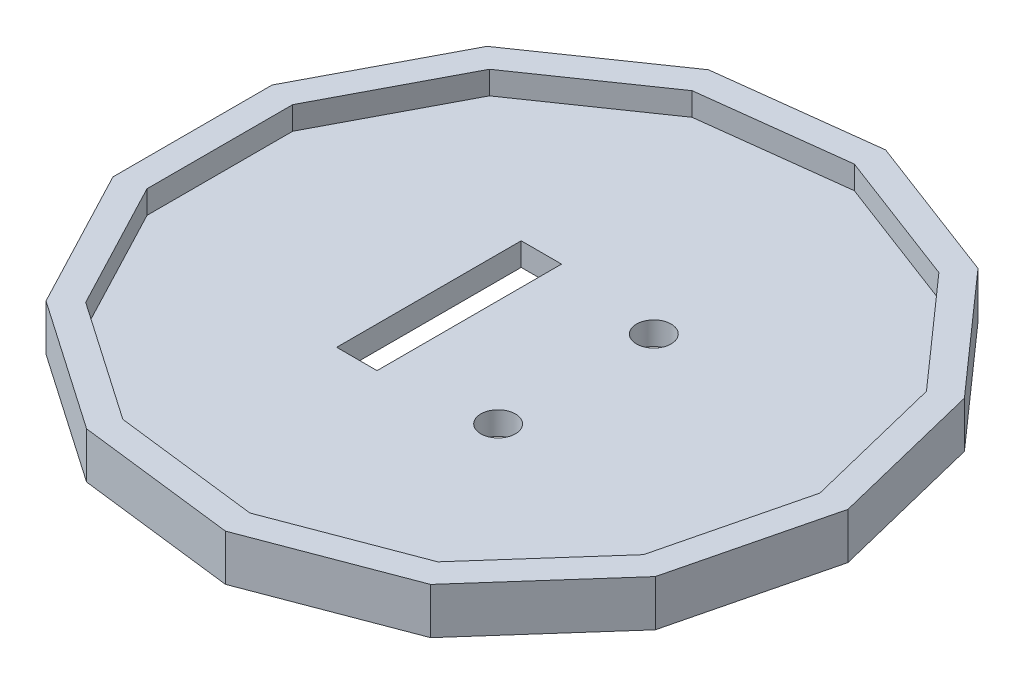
ISO-10303-21;
HEADER;
FILE_DESCRIPTION(('STEP AP214'),'2;1');
FILE_NAME('part.step','',(''),(''),'','','');
FILE_SCHEMA(('AUTOMOTIVE_DESIGN { 1 0 10303 214 1 1 1 1 }'));
ENDSEC;
DATA;
#1=APPLICATION_CONTEXT('core data for automotive mechanical design processes');
#2=APPLICATION_PROTOCOL_DEFINITION('international standard','automotive_design',2000,#1);
#3=PRODUCT_CONTEXT('',#1,'mechanical');
#4=PRODUCT('Part','Part','',(#3));
#5=PRODUCT_RELATED_PRODUCT_CATEGORY('part','',(#4));
#6=PRODUCT_DEFINITION_FORMATION('','',#4);
#7=PRODUCT_DEFINITION_CONTEXT('part definition',#1,'design');
#8=PRODUCT_DEFINITION('design','',#6,#7);
#9=PRODUCT_DEFINITION_SHAPE('','',#8);
#10=(LENGTH_UNIT() NAMED_UNIT(*) SI_UNIT(.MILLI.,.METRE.));
#11=(NAMED_UNIT(*) PLANE_ANGLE_UNIT() SI_UNIT($,.RADIAN.));
#12=(NAMED_UNIT(*) SI_UNIT($,.STERADIAN.) SOLID_ANGLE_UNIT());
#13=UNCERTAINTY_MEASURE_WITH_UNIT(LENGTH_MEASURE(1.E-05),#10,'distance_accuracy_value','');
#14=(GEOMETRIC_REPRESENTATION_CONTEXT(3) GLOBAL_UNCERTAINTY_ASSIGNED_CONTEXT((#13)) GLOBAL_UNIT_ASSIGNED_CONTEXT((#10,
#11,#12)) REPRESENTATION_CONTEXT('',''));
#15=CARTESIAN_POINT('',(0.,0.,0.));
#16=DIRECTION('',(0.,0.,1.));
#17=DIRECTION('',(1.,0.,0.));
#18=AXIS2_PLACEMENT_3D('',#15,#16,#17);
#19=CARTESIAN_POINT('',(-10.226088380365,4.,-26.9639790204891));
#20=DIRECTION('',(0.568064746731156,0.,0.822983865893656));
#21=DIRECTION('',(0.822983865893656,0.,-0.568064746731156));
#22=AXIS2_PLACEMENT_3D('',#19,#20,#21);
#23=PLANE('',#22);
#24=DIRECTION('',(-0.822983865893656,0.,0.568064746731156));
#25=VECTOR('',#24,1.);
#26=CARTESIAN_POINT('',(-10.226088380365,0.,-26.9639790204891));
#27=LINE('',#26,#25);
#28=CARTESIAN_POINT('',(-10.226088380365,0.,-26.9639790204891));
#29=VERTEX_POINT('',#28);
#30=CARTESIAN_POINT('',(-21.5855374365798,0.,-19.1231174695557));
#31=VERTEX_POINT('',#30);
#32=EDGE_CURVE('E359',#29,#31,#27,.T.);
#33=ORIENTED_EDGE('',*,*,#32,.T.);
#34=DIRECTION('',(0.,-1.,0.));
#35=VECTOR('',#34,1.);
#36=CARTESIAN_POINT('',(-21.5855374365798,4.,-19.1231174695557));
#37=LINE('',#36,#35);
#38=CARTESIAN_POINT('',(-21.5855374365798,4.,-19.1231174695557));
#39=VERTEX_POINT('',#38);
#40=EDGE_CURVE('E11',#39,#31,#37,.T.);
#41=ORIENTED_EDGE('',*,*,#40,.F.);
#42=DIRECTION('',(-0.822983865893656,0.,0.568064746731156));
#43=VECTOR('',#42,1.);
#44=CARTESIAN_POINT('',(-10.226088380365,4.,-26.9639790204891));
#45=LINE('',#44,#43);
#46=CARTESIAN_POINT('',(-10.226088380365,4.,-26.9639790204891));
#47=VERTEX_POINT('',#46);
#48=EDGE_CURVE('E384',#47,#39,#45,.T.);
#49=ORIENTED_EDGE('',*,*,#48,.F.);
#50=DIRECTION('',(0.,-1.,0.));
#51=VECTOR('',#50,1.);
#52=CARTESIAN_POINT('',(-10.226088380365,4.,-26.9639790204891));
#53=LINE('',#52,#51);
#54=EDGE_CURVE('E412',#47,#29,#53,.T.);
#55=ORIENTED_EDGE('',*,*,#54,.T.);
#56=EDGE_LOOP('',(#33,#41,#49,#55));
#57=FACE_BOUND('',#56,.T.);
#58=ADVANCED_FACE('F37',(#57),#23,.F.);
#59=CARTESIAN_POINT('',(-21.5855374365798,4.,-19.1231174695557));
#60=DIRECTION('',(0.88545602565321,0.,0.464723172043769));
#61=DIRECTION('',(0.464723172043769,0.,-0.88545602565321));
#62=AXIS2_PLACEMENT_3D('',#59,#60,#61);
#63=PLANE('',#62);
#64=DIRECTION('',(-0.464723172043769,0.,0.88545602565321));
#65=VECTOR('',#64,1.);
#66=CARTESIAN_POINT('',(-21.5855374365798,0.,-19.1231174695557));
#67=LINE('',#66,#65);
#68=CARTESIAN_POINT('',(-28.,0.,-6.90138016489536));
#69=VERTEX_POINT('',#68);
#70=EDGE_CURVE('E415',#31,#69,#67,.T.);
#71=ORIENTED_EDGE('',*,*,#70,.T.);
#72=DIRECTION('',(0.,-1.,0.));
#73=VECTOR('',#72,1.);
#74=CARTESIAN_POINT('',(-28.,4.,-6.90138016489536));
#75=LINE('',#74,#73);
#76=CARTESIAN_POINT('',(-28.,4.,-6.90138016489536));
#77=VERTEX_POINT('',#76);
#78=EDGE_CURVE('E44',#77,#69,#75,.T.);
#79=ORIENTED_EDGE('',*,*,#78,.F.);
#80=DIRECTION('',(-0.464723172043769,0.,0.88545602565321));
#81=VECTOR('',#80,1.);
#82=CARTESIAN_POINT('',(-21.5855374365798,4.,-19.1231174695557));
#83=LINE('',#82,#81);
#84=EDGE_CURVE('E387',#39,#77,#83,.T.);
#85=ORIENTED_EDGE('',*,*,#84,.F.);
#86=ORIENTED_EDGE('',*,*,#40,.T.);
#87=EDGE_LOOP('',(#71,#79,#85,#86));
#88=FACE_BOUND('',#87,.T.);
#89=ADVANCED_FACE('F497',(#88),#63,.F.);
#90=CARTESIAN_POINT('',(-28.,4.,-6.90138016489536));
#91=DIRECTION('',(1.,0.,0.));
#92=DIRECTION('',(0.,0.,-1.));
#93=AXIS2_PLACEMENT_3D('',#90,#91,#92);
#94=PLANE('',#93);
#95=DIRECTION('',(0.,0.,1.));
#96=VECTOR('',#95,1.);
#97=CARTESIAN_POINT('',(-28.,0.,-6.90138016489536));
#98=LINE('',#97,#96);
#99=CARTESIAN_POINT('',(-28.,0.,6.90138016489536));
#100=VERTEX_POINT('',#99);
#101=EDGE_CURVE('E417',#69,#100,#98,.T.);
#102=ORIENTED_EDGE('',*,*,#101,.T.);
#103=DIRECTION('',(0.,-1.,0.));
#104=VECTOR('',#103,1.);
#105=CARTESIAN_POINT('',(-28.,4.,6.90138016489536));
#106=LINE('',#105,#104);
#107=CARTESIAN_POINT('',(-28.,4.,6.90138016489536));
#108=VERTEX_POINT('',#107);
#109=EDGE_CURVE('E467',#108,#100,#106,.T.);
#110=ORIENTED_EDGE('',*,*,#109,.F.);
#111=DIRECTION('',(0.,0.,1.));
#112=VECTOR('',#111,1.);
#113=CARTESIAN_POINT('',(-28.,4.,-6.90138016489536));
#114=LINE('',#113,#112);
#115=EDGE_CURVE('E390',#77,#108,#114,.T.);
#116=ORIENTED_EDGE('',*,*,#115,.F.);
#117=ORIENTED_EDGE('',*,*,#78,.T.);
#118=EDGE_LOOP('',(#102,#110,#116,#117));
#119=FACE_BOUND('',#118,.T.);
#120=ADVANCED_FACE('F474',(#119),#94,.F.);
#121=CARTESIAN_POINT('',(-28.,4.,6.90138016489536));
#122=DIRECTION('',(0.88545602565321,0.,-0.464723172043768));
#123=DIRECTION('',(-0.464723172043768,0.,-0.88545602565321));
#124=AXIS2_PLACEMENT_3D('',#121,#122,#123);
#125=PLANE('',#124);
#126=DIRECTION('',(0.464723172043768,0.,0.88545602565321));
#127=VECTOR('',#126,1.);
#128=CARTESIAN_POINT('',(-28.,0.,6.90138016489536));
#129=LINE('',#128,#127);
#130=CARTESIAN_POINT('',(-21.5855374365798,0.,19.1231174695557));
#131=VERTEX_POINT('',#130);
#132=EDGE_CURVE('E419',#100,#131,#129,.T.);
#133=ORIENTED_EDGE('',*,*,#132,.T.);
#134=DIRECTION('',(0.,-1.,0.));
#135=VECTOR('',#134,1.);
#136=CARTESIAN_POINT('',(-21.5855374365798,4.,19.1231174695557));
#137=LINE('',#136,#135);
#138=CARTESIAN_POINT('',(-21.5855374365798,4.,19.1231174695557));
#139=VERTEX_POINT('',#138);
#140=EDGE_CURVE('E464',#139,#131,#137,.T.);
#141=ORIENTED_EDGE('',*,*,#140,.F.);
#142=DIRECTION('',(0.464723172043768,0.,0.88545602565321));
#143=VECTOR('',#142,1.);
#144=CARTESIAN_POINT('',(-28.,4.,6.90138016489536));
#145=LINE('',#144,#143);
#146=EDGE_CURVE('E392',#108,#139,#145,.T.);
#147=ORIENTED_EDGE('',*,*,#146,.F.);
#148=ORIENTED_EDGE('',*,*,#109,.T.);
#149=EDGE_LOOP('',(#133,#141,#147,#148));
#150=FACE_BOUND('',#149,.T.);
#151=ADVANCED_FACE('F485',(#150),#125,.F.);
#152=CARTESIAN_POINT('',(-21.5855374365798,4.,19.1231174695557));
#153=DIRECTION('',(0.568064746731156,0.,-0.822983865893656));
#154=DIRECTION('',(-0.822983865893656,0.,-0.568064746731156));
#155=AXIS2_PLACEMENT_3D('',#152,#153,#154);
#156=PLANE('',#155);
#157=DIRECTION('',(0.822983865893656,0.,0.568064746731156));
#158=VECTOR('',#157,1.);
#159=CARTESIAN_POINT('',(-21.5855374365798,0.,19.1231174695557));
#160=LINE('',#159,#158);
#161=CARTESIAN_POINT('',(-10.226088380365,0.,26.9639790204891));
#162=VERTEX_POINT('',#161);
#163=EDGE_CURVE('E421',#131,#162,#160,.T.);
#164=ORIENTED_EDGE('',*,*,#163,.T.);
#165=DIRECTION('',(0.,-1.,0.));
#166=VECTOR('',#165,1.);
#167=CARTESIAN_POINT('',(-10.226088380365,4.,26.9639790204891));
#168=LINE('',#167,#166);
#169=CARTESIAN_POINT('',(-10.226088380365,4.,26.9639790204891));
#170=VERTEX_POINT('',#169);
#171=EDGE_CURVE('E461',#170,#162,#168,.T.);
#172=ORIENTED_EDGE('',*,*,#171,.F.);
#173=DIRECTION('',(0.822983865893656,0.,0.568064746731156));
#174=VECTOR('',#173,1.);
#175=CARTESIAN_POINT('',(-21.5855374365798,4.,19.1231174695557));
#176=LINE('',#175,#174);
#177=EDGE_CURVE('E394',#139,#170,#176,.T.);
#178=ORIENTED_EDGE('',*,*,#177,.F.);
#179=ORIENTED_EDGE('',*,*,#140,.T.);
#180=EDGE_LOOP('',(#164,#172,#178,#179));
#181=FACE_BOUND('',#180,.T.);
#182=ADVANCED_FACE('F489',(#181),#156,.F.);
#183=CARTESIAN_POINT('',(-10.226088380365,4.,26.9639790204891));
#184=DIRECTION('',(0.120536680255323,0.,-0.992708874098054));
#185=DIRECTION('',(-0.992708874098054,0.,-0.120536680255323));
#186=AXIS2_PLACEMENT_3D('',#183,#184,#185);
#187=PLANE('',#186);
#188=DIRECTION('',(0.992708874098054,0.,0.120536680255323));
#189=VECTOR('',#188,1.);
#190=CARTESIAN_POINT('',(-10.226088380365,0.,26.9639790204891));
#191=LINE('',#190,#189);
#192=CARTESIAN_POINT('',(3.47603428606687,0.,28.6277179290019));
#193=VERTEX_POINT('',#192);
#194=EDGE_CURVE('E423',#162,#193,#191,.T.);
#195=ORIENTED_EDGE('',*,*,#194,.T.);
#196=DIRECTION('',(0.,-1.,0.));
#197=VECTOR('',#196,1.);
#198=CARTESIAN_POINT('',(3.47603428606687,4.,28.6277179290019));
#199=LINE('',#198,#197);
#200=CARTESIAN_POINT('',(3.47603428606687,4.,28.6277179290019));
#201=VERTEX_POINT('',#200);
#202=EDGE_CURVE('E458',#201,#193,#199,.T.);
#203=ORIENTED_EDGE('',*,*,#202,.F.);
#204=DIRECTION('',(0.992708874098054,0.,0.120536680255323));
#205=VECTOR('',#204,1.);
#206=CARTESIAN_POINT('',(-10.226088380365,4.,26.9639790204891));
#207=LINE('',#206,#205);
#208=EDGE_CURVE('E396',#170,#201,#207,.T.);
#209=ORIENTED_EDGE('',*,*,#208,.F.);
#210=ORIENTED_EDGE('',*,*,#171,.T.);
#211=EDGE_LOOP('',(#195,#203,#209,#210));
#212=FACE_BOUND('',#211,.T.);
#213=ADVANCED_FACE('F535',(#212),#187,.F.);
#214=CARTESIAN_POINT('',(3.47603428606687,4.,28.6277179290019));
#215=DIRECTION('',(-0.354604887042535,0.,-0.935016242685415));
#216=DIRECTION('',(-0.935016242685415,0.,0.354604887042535));
#217=AXIS2_PLACEMENT_3D('',#214,#215,#216);
#218=PLANE('',#217);
#219=DIRECTION('',(0.935016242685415,0.,-0.354604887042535));
#220=VECTOR('',#219,1.);
#221=CARTESIAN_POINT('',(3.47603428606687,0.,28.6277179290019));
#222=LINE('',#221,#220);
#223=CARTESIAN_POINT('',(16.3818393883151,0.,23.7331916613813));
#224=VERTEX_POINT('',#223);
#225=EDGE_CURVE('E425',#193,#224,#222,.T.);
#226=ORIENTED_EDGE('',*,*,#225,.T.);
#227=DIRECTION('',(0.,-1.,0.));
#228=VECTOR('',#227,1.);
#229=CARTESIAN_POINT('',(16.3818393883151,4.,23.7331916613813));
#230=LINE('',#229,#228);
#231=CARTESIAN_POINT('',(16.3818393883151,4.,23.7331916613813));
#232=VERTEX_POINT('',#231);
#233=EDGE_CURVE('E455',#232,#224,#230,.T.);
#234=ORIENTED_EDGE('',*,*,#233,.F.);
#235=DIRECTION('',(0.935016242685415,0.,-0.354604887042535));
#236=VECTOR('',#235,1.);
#237=CARTESIAN_POINT('',(3.47603428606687,4.,28.6277179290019));
#238=LINE('',#237,#236);
#239=EDGE_CURVE('E398',#201,#232,#238,.T.);
#240=ORIENTED_EDGE('',*,*,#239,.F.);
#241=ORIENTED_EDGE('',*,*,#202,.T.);
#242=EDGE_LOOP('',(#226,#234,#240,#241));
#243=FACE_BOUND('',#242,.T.);
#244=ADVANCED_FACE('F532',(#243),#218,.F.);
#245=CARTESIAN_POINT('',(16.3818393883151,4.,23.7331916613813));
#246=DIRECTION('',(-0.748510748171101,0.,-0.663122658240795));
#247=DIRECTION('',(-0.663122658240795,0.,0.748510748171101));
#248=AXIS2_PLACEMENT_3D('',#245,#246,#247);
#249=PLANE('',#248);
#250=DIRECTION('',(0.663122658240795,0.,-0.748510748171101));
#251=VECTOR('',#250,1.);
#252=CARTESIAN_POINT('',(16.3818393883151,0.,23.7331916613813));
#253=LINE('',#252,#251);
#254=CARTESIAN_POINT('',(25.5347625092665,0.,13.4016772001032));
#255=VERTEX_POINT('',#254);
#256=EDGE_CURVE('E427',#224,#255,#253,.T.);
#257=ORIENTED_EDGE('',*,*,#256,.T.);
#258=DIRECTION('',(0.,-1.,0.));
#259=VECTOR('',#258,1.);
#260=CARTESIAN_POINT('',(25.5347625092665,4.,13.4016772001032));
#261=LINE('',#260,#259);
#262=CARTESIAN_POINT('',(25.5347625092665,4.,13.4016772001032));
#263=VERTEX_POINT('',#262);
#264=EDGE_CURVE('E452',#263,#255,#261,.T.);
#265=ORIENTED_EDGE('',*,*,#264,.F.);
#266=DIRECTION('',(0.663122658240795,0.,-0.748510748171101));
#267=VECTOR('',#266,1.);
#268=CARTESIAN_POINT('',(16.3818393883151,4.,23.7331916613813));
#269=LINE('',#268,#267);
#270=EDGE_CURVE('E400',#232,#263,#269,.T.);
#271=ORIENTED_EDGE('',*,*,#270,.F.);
#272=ORIENTED_EDGE('',*,*,#233,.T.);
#273=EDGE_LOOP('',(#257,#265,#271,#272));
#274=FACE_BOUND('',#273,.T.);
#275=ADVANCED_FACE('F528',(#274),#249,.F.);
#276=CARTESIAN_POINT('',(25.5347625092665,4.,13.4016772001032));
#277=DIRECTION('',(-0.970941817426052,0.,-0.239315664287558));
#278=DIRECTION('',(-0.239315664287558,0.,0.970941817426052));
#279=AXIS2_PLACEMENT_3D('',#276,#277,#278);
#280=PLANE('',#279);
#281=DIRECTION('',(0.239315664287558,0.,-0.970941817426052));
#282=VECTOR('',#281,1.);
#283=CARTESIAN_POINT('',(25.5347625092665,0.,13.4016772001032));
#284=LINE('',#283,#282);
#285=CARTESIAN_POINT('',(28.8379792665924,0.,0.));
#286=VERTEX_POINT('',#285);
#287=EDGE_CURVE('E429',#255,#286,#284,.T.);
#288=ORIENTED_EDGE('',*,*,#287,.T.);
#289=DIRECTION('',(0.,-1.,0.));
#290=VECTOR('',#289,1.);
#291=CARTESIAN_POINT('',(28.8379792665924,4.,0.));
#292=LINE('',#291,#290);
#293=CARTESIAN_POINT('',(28.8379792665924,4.,0.));
#294=VERTEX_POINT('',#293);
#295=EDGE_CURVE('E449',#294,#286,#292,.T.);
#296=ORIENTED_EDGE('',*,*,#295,.F.);
#297=DIRECTION('',(0.239315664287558,0.,-0.970941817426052));
#298=VECTOR('',#297,1.);
#299=CARTESIAN_POINT('',(25.5347625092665,4.,13.4016772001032));
#300=LINE('',#299,#298);
#301=EDGE_CURVE('E402',#263,#294,#300,.T.);
#302=ORIENTED_EDGE('',*,*,#301,.F.);
#303=ORIENTED_EDGE('',*,*,#264,.T.);
#304=EDGE_LOOP('',(#288,#296,#302,#303));
#305=FACE_BOUND('',#304,.T.);
#306=ADVANCED_FACE('F524',(#305),#280,.F.);
#307=CARTESIAN_POINT('',(28.8379792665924,4.,0.));
#308=DIRECTION('',(-0.970941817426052,0.,0.239315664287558));
#309=DIRECTION('',(0.239315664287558,0.,0.970941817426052));
#310=AXIS2_PLACEMENT_3D('',#307,#308,#309);
#311=PLANE('',#310);
#312=DIRECTION('',(-0.239315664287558,0.,-0.970941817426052));
#313=VECTOR('',#312,1.);
#314=CARTESIAN_POINT('',(28.8379792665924,0.,0.));
#315=LINE('',#314,#313);
#316=CARTESIAN_POINT('',(25.5347625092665,0.,-13.4016772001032));
#317=VERTEX_POINT('',#316);
#318=EDGE_CURVE('E431',#286,#317,#315,.T.);
#319=ORIENTED_EDGE('',*,*,#318,.T.);
#320=DIRECTION('',(0.,-1.,0.));
#321=VECTOR('',#320,1.);
#322=CARTESIAN_POINT('',(25.5347625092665,4.,-13.4016772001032));
#323=LINE('',#322,#321);
#324=CARTESIAN_POINT('',(25.5347625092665,4.,-13.4016772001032));
#325=VERTEX_POINT('',#324);
#326=EDGE_CURVE('E446',#325,#317,#323,.T.);
#327=ORIENTED_EDGE('',*,*,#326,.F.);
#328=DIRECTION('',(-0.239315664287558,0.,-0.970941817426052));
#329=VECTOR('',#328,1.);
#330=CARTESIAN_POINT('',(28.8379792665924,4.,0.));
#331=LINE('',#330,#329);
#332=EDGE_CURVE('E404',#294,#325,#331,.T.);
#333=ORIENTED_EDGE('',*,*,#332,.F.);
#334=ORIENTED_EDGE('',*,*,#295,.T.);
#335=EDGE_LOOP('',(#319,#327,#333,#334));
#336=FACE_BOUND('',#335,.T.);
#337=ADVANCED_FACE('F519',(#336),#311,.F.);
#338=CARTESIAN_POINT('',(25.5347625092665,4.,-13.4016772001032));
#339=DIRECTION('',(-0.748510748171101,0.,0.663122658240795));
#340=DIRECTION('',(0.663122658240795,0.,0.748510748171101));
#341=AXIS2_PLACEMENT_3D('',#338,#339,#340);
#342=PLANE('',#341);
#343=DIRECTION('',(-0.663122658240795,0.,-0.748510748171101));
#344=VECTOR('',#343,1.);
#345=CARTESIAN_POINT('',(25.5347625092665,0.,-13.4016772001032));
#346=LINE('',#345,#344);
#347=CARTESIAN_POINT('',(16.3818393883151,0.,-23.7331916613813));
#348=VERTEX_POINT('',#347);
#349=EDGE_CURVE('E433',#317,#348,#346,.T.);
#350=ORIENTED_EDGE('',*,*,#349,.T.);
#351=DIRECTION('',(0.,-1.,0.));
#352=VECTOR('',#351,1.);
#353=CARTESIAN_POINT('',(16.3818393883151,4.,-23.7331916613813));
#354=LINE('',#353,#352);
#355=CARTESIAN_POINT('',(16.3818393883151,4.,-23.7331916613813));
#356=VERTEX_POINT('',#355);
#357=EDGE_CURVE('E443',#356,#348,#354,.T.);
#358=ORIENTED_EDGE('',*,*,#357,.F.);
#359=DIRECTION('',(-0.663122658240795,0.,-0.748510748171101));
#360=VECTOR('',#359,1.);
#361=CARTESIAN_POINT('',(25.5347625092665,4.,-13.4016772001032));
#362=LINE('',#361,#360);
#363=EDGE_CURVE('E406',#325,#356,#362,.T.);
#364=ORIENTED_EDGE('',*,*,#363,.F.);
#365=ORIENTED_EDGE('',*,*,#326,.T.);
#366=EDGE_LOOP('',(#350,#358,#364,#365));
#367=FACE_BOUND('',#366,.T.);
#368=ADVANCED_FACE('F513',(#367),#342,.F.);
#369=CARTESIAN_POINT('',(16.3818393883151,4.,-23.7331916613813));
#370=DIRECTION('',(-0.354604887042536,0.,0.935016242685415));
#371=DIRECTION('',(0.935016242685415,0.,0.354604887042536));
#372=AXIS2_PLACEMENT_3D('',#369,#370,#371);
#373=PLANE('',#372);
#374=DIRECTION('',(-0.935016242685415,0.,-0.354604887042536));
#375=VECTOR('',#374,1.);
#376=CARTESIAN_POINT('',(16.3818393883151,0.,-23.7331916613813));
#377=LINE('',#376,#375);
#378=CARTESIAN_POINT('',(3.47603428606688,0.,-28.6277179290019));
#379=VERTEX_POINT('',#378);
#380=EDGE_CURVE('E435',#348,#379,#377,.T.);
#381=ORIENTED_EDGE('',*,*,#380,.T.);
#382=DIRECTION('',(0.,-1.,0.));
#383=VECTOR('',#382,1.);
#384=CARTESIAN_POINT('',(3.47603428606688,4.,-28.6277179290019));
#385=LINE('',#384,#383);
#386=CARTESIAN_POINT('',(3.47603428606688,4.,-28.6277179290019));
#387=VERTEX_POINT('',#386);
#388=EDGE_CURVE('E440',#387,#379,#385,.T.);
#389=ORIENTED_EDGE('',*,*,#388,.F.);
#390=DIRECTION('',(-0.935016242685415,0.,-0.354604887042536));
#391=VECTOR('',#390,1.);
#392=CARTESIAN_POINT('',(16.3818393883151,4.,-23.7331916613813));
#393=LINE('',#392,#391);
#394=EDGE_CURVE('E408',#356,#387,#393,.T.);
#395=ORIENTED_EDGE('',*,*,#394,.F.);
#396=ORIENTED_EDGE('',*,*,#357,.T.);
#397=EDGE_LOOP('',(#381,#389,#395,#396));
#398=FACE_BOUND('',#397,.T.);
#399=ADVANCED_FACE('F509',(#398),#373,.F.);
#400=CARTESIAN_POINT('',(3.47603428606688,4.,-28.6277179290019));
#401=DIRECTION('',(0.120536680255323,0.,0.992708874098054));
#402=DIRECTION('',(0.992708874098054,0.,-0.120536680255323));
#403=AXIS2_PLACEMENT_3D('',#400,#401,#402);
#404=PLANE('',#403);
#405=DIRECTION('',(-0.992708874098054,0.,0.120536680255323));
#406=VECTOR('',#405,1.);
#407=CARTESIAN_POINT('',(3.47603428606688,0.,-28.6277179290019));
#408=LINE('',#407,#406);
#409=EDGE_CURVE('E388',#379,#29,#408,.T.);
#410=ORIENTED_EDGE('',*,*,#409,.T.);
#411=ORIENTED_EDGE('',*,*,#54,.F.);
#412=DIRECTION('',(-0.992708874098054,0.,0.120536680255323));
#413=VECTOR('',#412,1.);
#414=CARTESIAN_POINT('',(3.47603428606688,4.,-28.6277179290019));
#415=LINE('',#414,#413);
#416=EDGE_CURVE('E410',#387,#47,#415,.T.);
#417=ORIENTED_EDGE('',*,*,#416,.F.);
#418=ORIENTED_EDGE('',*,*,#388,.T.);
#419=EDGE_LOOP('',(#410,#411,#417,#418));
#420=FACE_BOUND('',#419,.T.);
#421=ADVANCED_FACE('F504',(#420),#404,.F.);
#422=CARTESIAN_POINT('',(0.,4.,0.));
#423=DIRECTION('',(0.,1.,0.));
#424=DIRECTION('',(0.,0.,1.));
#425=AXIS2_PLACEMENT_3D('',#422,#423,#424);
#426=PLANE('',#425);
#427=DIRECTION('',(0.23931566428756,0.,-0.970941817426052));
#428=VECTOR('',#427,1.);
#429=CARTESIAN_POINT('',(23.3760390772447,4.,12.2686917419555));
#430=LINE('',#429,#428);
#431=CARTESIAN_POINT('',(23.3760390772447,4.,12.2686917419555));
#432=VERTEX_POINT('',#431);
#433=CARTESIAN_POINT('',(26.4,4.,0.));
#434=VERTEX_POINT('',#433);
#435=EDGE_CURVE('E275',#432,#434,#430,.T.);
#436=ORIENTED_EDGE('',*,*,#435,.F.);
#437=DIRECTION('',(0.663122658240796,0.,-0.7485107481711));
#438=VECTOR('',#437,1.);
#439=CARTESIAN_POINT('',(14.9969093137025,4.,21.7267740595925));
#440=LINE('',#439,#438);
#441=CARTESIAN_POINT('',(14.9969093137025,4.,21.7267740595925));
#442=VERTEX_POINT('',#441);
#443=EDGE_CURVE('E284',#442,#432,#440,.T.);
#444=ORIENTED_EDGE('',*,*,#443,.F.);
#445=DIRECTION('',(0.935016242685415,0.,-0.354604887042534));
#446=VECTOR('',#445,1.);
#447=CARTESIAN_POINT('',(3.18216835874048,4.,26.2075142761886));
#448=LINE('',#447,#446);
#449=CARTESIAN_POINT('',(3.18216835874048,4.,26.2075142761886));
#450=VERTEX_POINT('',#449);
#451=EDGE_CURVE('E352',#450,#442,#448,.T.);
#452=ORIENTED_EDGE('',*,*,#451,.F.);
#453=DIRECTION('',(0.992708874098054,0.,0.120536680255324));
#454=VECTOR('',#453,1.);
#455=CARTESIAN_POINT('',(-9.36156901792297,4.,24.6844288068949));
#456=LINE('',#455,#454);
#457=CARTESIAN_POINT('',(-9.36156901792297,4.,24.6844288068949));
#458=VERTEX_POINT('',#457);
#459=EDGE_CURVE('E349',#458,#450,#456,.T.);
#460=ORIENTED_EDGE('',*,*,#459,.F.);
#461=DIRECTION('',(0.822983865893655,0.,0.568064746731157));
#462=VECTOR('',#461,1.);
#463=CARTESIAN_POINT('',(-19.7606837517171,4.,17.506438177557));
#464=LINE('',#463,#462);
#465=CARTESIAN_POINT('',(-19.7606837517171,4.,17.506438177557));
#466=VERTEX_POINT('',#465);
#467=EDGE_CURVE('E346',#466,#458,#464,.T.);
#468=ORIENTED_EDGE('',*,*,#467,.F.);
#469=DIRECTION('',(0.464723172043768,0.,0.88545602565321));
#470=VECTOR('',#469,1.);
#471=CARTESIAN_POINT('',(-25.6328639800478,4.,6.31793353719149));
#472=LINE('',#471,#470);
#473=CARTESIAN_POINT('',(-25.6328639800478,4.,6.31793353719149));
#474=VERTEX_POINT('',#473);
#475=EDGE_CURVE('E343',#474,#466,#472,.T.);
#476=ORIENTED_EDGE('',*,*,#475,.F.);
#477=DIRECTION('',(0.,0.,1.));
#478=VECTOR('',#477,1.);
#479=CARTESIAN_POINT('',(-25.6328639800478,4.,-6.31793353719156));
#480=LINE('',#479,#478);
#481=CARTESIAN_POINT('',(-25.6328639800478,4.,-6.31793353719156));
#482=VERTEX_POINT('',#481);
#483=EDGE_CURVE('E340',#482,#474,#480,.T.);
#484=ORIENTED_EDGE('',*,*,#483,.F.);
#485=DIRECTION('',(-0.46472317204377,0.,0.885456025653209));
#486=VECTOR('',#485,1.);
#487=CARTESIAN_POINT('',(-19.760683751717,4.,-17.506438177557));
#488=LINE('',#487,#486);
#489=CARTESIAN_POINT('',(-19.760683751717,4.,-17.506438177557));
#490=VERTEX_POINT('',#489);
#491=EDGE_CURVE('E337',#490,#482,#488,.T.);
#492=ORIENTED_EDGE('',*,*,#491,.F.);
#493=DIRECTION('',(-0.822983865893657,0.,0.568064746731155));
#494=VECTOR('',#493,1.);
#495=CARTESIAN_POINT('',(-9.36156901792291,4.,-24.6844288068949));
#496=LINE('',#495,#494);
#497=CARTESIAN_POINT('',(-9.36156901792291,4.,-24.6844288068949));
#498=VERTEX_POINT('',#497);
#499=EDGE_CURVE('E334',#498,#490,#496,.T.);
#500=ORIENTED_EDGE('',*,*,#499,.F.);
#501=DIRECTION('',(-0.992708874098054,0.,0.120536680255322));
#502=VECTOR('',#501,1.);
#503=CARTESIAN_POINT('',(3.1821683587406,4.,-26.2075142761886));
#504=LINE('',#503,#502);
#505=CARTESIAN_POINT('',(3.1821683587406,4.,-26.2075142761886));
#506=VERTEX_POINT('',#505);
#507=EDGE_CURVE('E331',#506,#498,#504,.T.);
#508=ORIENTED_EDGE('',*,*,#507,.F.);
#509=DIRECTION('',(-0.935016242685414,0.,-0.354604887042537));
#510=VECTOR('',#509,1.);
#511=CARTESIAN_POINT('',(14.9969093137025,4.,-21.7267740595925));
#512=LINE('',#511,#510);
#513=CARTESIAN_POINT('',(14.9969093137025,4.,-21.7267740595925));
#514=VERTEX_POINT('',#513);
#515=EDGE_CURVE('E328',#514,#506,#512,.T.);
#516=ORIENTED_EDGE('',*,*,#515,.F.);
#517=DIRECTION('',(-0.663122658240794,0.,-0.748510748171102));
#518=VECTOR('',#517,1.);
#519=CARTESIAN_POINT('',(23.3760390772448,4.,-12.2686917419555));
#520=LINE('',#519,#518);
#521=CARTESIAN_POINT('',(23.3760390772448,4.,-12.2686917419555));
#522=VERTEX_POINT('',#521);
#523=EDGE_CURVE('E325',#522,#514,#520,.T.);
#524=ORIENTED_EDGE('',*,*,#523,.F.);
#525=DIRECTION('',(-0.239315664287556,0.,-0.970941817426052));
#526=VECTOR('',#525,1.);
#527=CARTESIAN_POINT('',(26.4,4.,0.));
#528=LINE('',#527,#526);
#529=EDGE_CURVE('E322',#434,#522,#528,.T.);
#530=ORIENTED_EDGE('',*,*,#529,.F.);
#531=EDGE_LOOP('',(#436,#444,#452,#460,#468,#476,#484,#492,#500,#508,#516,#524,#530));
#532=FACE_BOUND('',#531,.T.);
#533=ORIENTED_EDGE('',*,*,#48,.T.);
#534=ORIENTED_EDGE('',*,*,#84,.T.);
#535=ORIENTED_EDGE('',*,*,#115,.T.);
#536=ORIENTED_EDGE('',*,*,#146,.T.);
#537=ORIENTED_EDGE('',*,*,#177,.T.);
#538=ORIENTED_EDGE('',*,*,#208,.T.);
#539=ORIENTED_EDGE('',*,*,#239,.T.);
#540=ORIENTED_EDGE('',*,*,#270,.T.);
#541=ORIENTED_EDGE('',*,*,#301,.T.);
#542=ORIENTED_EDGE('',*,*,#332,.T.);
#543=ORIENTED_EDGE('',*,*,#363,.T.);
#544=ORIENTED_EDGE('',*,*,#394,.T.);
#545=ORIENTED_EDGE('',*,*,#416,.T.);
#546=EDGE_LOOP('',(#533,#534,#535,#536,#537,#538,#539,#540,#541,#542,#543,#544,#545));
#547=FACE_BOUND('',#546,.T.);
#548=ADVANCED_FACE('F493',(#532,#547),#426,.T.);
#549=CARTESIAN_POINT('',(0.,0.,0.));
#550=DIRECTION('',(0.,1.,0.));
#551=DIRECTION('',(0.,0.,1.));
#552=AXIS2_PLACEMENT_3D('',#549,#550,#551);
#553=PLANE('',#552);
#554=DIRECTION('',(0.,0.,-1.));
#555=VECTOR('',#554,1.);
#556=CARTESIAN_POINT('',(-4.,0.,8.));
#557=LINE('',#556,#555);
#558=CARTESIAN_POINT('',(-4.,0.,8.));
#559=VERTEX_POINT('',#558);
#560=CARTESIAN_POINT('',(-4.,0.,-8.));
#561=VERTEX_POINT('',#560);
#562=EDGE_CURVE('E51',#559,#561,#557,.T.);
#563=ORIENTED_EDGE('',*,*,#562,.T.);
#564=DIRECTION('',(-1.,0.,0.));
#565=VECTOR('',#564,1.);
#566=CARTESIAN_POINT('',(-7.5,0.,-8.));
#567=LINE('',#566,#565);
#568=CARTESIAN_POINT('',(-7.5,0.,-8.));
#569=VERTEX_POINT('',#568);
#570=EDGE_CURVE('E248',#561,#569,#567,.T.);
#571=ORIENTED_EDGE('',*,*,#570,.T.);
#572=DIRECTION('',(0.,0.,1.));
#573=VECTOR('',#572,1.);
#574=CARTESIAN_POINT('',(-7.5,0.,8.));
#575=LINE('',#574,#573);
#576=CARTESIAN_POINT('',(-7.5,0.,8.));
#577=VERTEX_POINT('',#576);
#578=EDGE_CURVE('E264',#569,#577,#575,.T.);
#579=ORIENTED_EDGE('',*,*,#578,.T.);
#580=DIRECTION('',(1.,0.,0.));
#581=VECTOR('',#580,1.);
#582=CARTESIAN_POINT('',(-7.5,0.,8.));
#583=LINE('',#582,#581);
#584=EDGE_CURVE('E242',#577,#559,#583,.T.);
#585=ORIENTED_EDGE('',*,*,#584,.T.);
#586=EDGE_LOOP('',(#563,#571,#579,#585));
#587=FACE_BOUND('',#586,.T.);
#588=CARTESIAN_POINT('',(5.25,0.,6.75));
#589=DIRECTION('',(0.,1.,0.));
#590=DIRECTION('',(0.,0.,-1.));
#591=AXIS2_PLACEMENT_3D('',#588,#589,#590);
#592=CIRCLE('',#591,1.5);
#593=CARTESIAN_POINT('',(5.25,0.,5.25));
#594=VERTEX_POINT('',#593);
#595=EDGE_CURVE('E249',#594,#594,#592,.T.);
#596=ORIENTED_EDGE('',*,*,#595,.T.);
#597=EDGE_LOOP('',(#596));
#598=FACE_BOUND('',#597,.T.);
#599=CARTESIAN_POINT('',(5.25,0.,-6.75));
#600=DIRECTION('',(0.,1.,0.));
#601=DIRECTION('',(0.,0.,1.));
#602=AXIS2_PLACEMENT_3D('',#599,#600,#601);
#603=CIRCLE('',#602,1.5);
#604=CARTESIAN_POINT('',(5.25,0.,-5.25));
#605=VERTEX_POINT('',#604);
#606=EDGE_CURVE('E276',#605,#605,#603,.T.);
#607=ORIENTED_EDGE('',*,*,#606,.T.);
#608=EDGE_LOOP('',(#607));
#609=FACE_BOUND('',#608,.T.);
#610=ORIENTED_EDGE('',*,*,#32,.F.);
#611=ORIENTED_EDGE('',*,*,#409,.F.);
#612=ORIENTED_EDGE('',*,*,#380,.F.);
#613=ORIENTED_EDGE('',*,*,#349,.F.);
#614=ORIENTED_EDGE('',*,*,#318,.F.);
#615=ORIENTED_EDGE('',*,*,#287,.F.);
#616=ORIENTED_EDGE('',*,*,#256,.F.);
#617=ORIENTED_EDGE('',*,*,#225,.F.);
#618=ORIENTED_EDGE('',*,*,#194,.F.);
#619=ORIENTED_EDGE('',*,*,#163,.F.);
#620=ORIENTED_EDGE('',*,*,#132,.F.);
#621=ORIENTED_EDGE('',*,*,#101,.F.);
#622=ORIENTED_EDGE('',*,*,#70,.F.);
#623=EDGE_LOOP('',(#610,#611,#612,#613,#614,#615,#616,#617,#618,#619,#620,#621,#622));
#624=FACE_BOUND('',#623,.T.);
#625=ADVANCED_FACE('F480',(#587,#598,#609,#624),#553,.F.);
#626=CARTESIAN_POINT('',(23.3760390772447,2.,12.2686917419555));
#627=DIRECTION('',(0.970941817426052,0.,0.23931566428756));
#628=DIRECTION('',(0.23931566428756,0.,-0.970941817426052));
#629=AXIS2_PLACEMENT_3D('',#626,#627,#628);
#630=PLANE('',#629);
#631=ORIENTED_EDGE('',*,*,#435,.T.);
#632=DIRECTION('',(0.,1.,0.));
#633=VECTOR('',#632,1.);
#634=CARTESIAN_POINT('',(26.4,2.,0.));
#635=LINE('',#634,#633);
#636=CARTESIAN_POINT('',(26.4,2.,0.));
#637=VERTEX_POINT('',#636);
#638=EDGE_CURVE('E320',#637,#434,#635,.T.);
#639=ORIENTED_EDGE('',*,*,#638,.F.);
#640=DIRECTION('',(0.23931566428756,0.,-0.970941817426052));
#641=VECTOR('',#640,1.);
#642=CARTESIAN_POINT('',(23.3760390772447,2.,12.2686917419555));
#643=LINE('',#642,#641);
#644=CARTESIAN_POINT('',(23.3760390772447,2.,12.2686917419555));
#645=VERTEX_POINT('',#644);
#646=EDGE_CURVE('E280',#645,#637,#643,.T.);
#647=ORIENTED_EDGE('',*,*,#646,.F.);
#648=DIRECTION('',(0.,1.,0.));
#649=VECTOR('',#648,1.);
#650=CARTESIAN_POINT('',(23.3760390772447,2.,12.2686917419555));
#651=LINE('',#650,#649);
#652=EDGE_CURVE('E357',#645,#432,#651,.T.);
#653=ORIENTED_EDGE('',*,*,#652,.T.);
#654=EDGE_LOOP('',(#631,#639,#647,#653));
#655=FACE_BOUND('',#654,.T.);
#656=ADVANCED_FACE('F636',(#655),#630,.F.);
#657=CARTESIAN_POINT('',(14.9969093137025,2.,21.7267740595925));
#658=DIRECTION('',(0.7485107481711,0.,0.663122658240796));
#659=DIRECTION('',(0.663122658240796,0.,-0.7485107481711));
#660=AXIS2_PLACEMENT_3D('',#657,#658,#659);
#661=PLANE('',#660);
#662=ORIENTED_EDGE('',*,*,#443,.T.);
#663=ORIENTED_EDGE('',*,*,#652,.F.);
#664=DIRECTION('',(0.663122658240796,0.,-0.7485107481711));
#665=VECTOR('',#664,1.);
#666=CARTESIAN_POINT('',(14.9969093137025,2.,21.7267740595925));
#667=LINE('',#666,#665);
#668=CARTESIAN_POINT('',(14.9969093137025,2.,21.7267740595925));
#669=VERTEX_POINT('',#668);
#670=EDGE_CURVE('E317',#669,#645,#667,.T.);
#671=ORIENTED_EDGE('',*,*,#670,.F.);
#672=DIRECTION('',(0.,1.,0.));
#673=VECTOR('',#672,1.);
#674=CARTESIAN_POINT('',(14.9969093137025,2.,21.7267740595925));
#675=LINE('',#674,#673);
#676=EDGE_CURVE('E360',#669,#442,#675,.T.);
#677=ORIENTED_EDGE('',*,*,#676,.T.);
#678=EDGE_LOOP('',(#662,#663,#671,#677));
#679=FACE_BOUND('',#678,.T.);
#680=ADVANCED_FACE('F641',(#679),#661,.F.);
#681=CARTESIAN_POINT('',(3.18216835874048,2.,26.2075142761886));
#682=DIRECTION('',(0.354604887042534,0.,0.935016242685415));
#683=DIRECTION('',(0.935016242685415,0.,-0.354604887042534));
#684=AXIS2_PLACEMENT_3D('',#681,#682,#683);
#685=PLANE('',#684);
#686=ORIENTED_EDGE('',*,*,#451,.T.);
#687=ORIENTED_EDGE('',*,*,#676,.F.);
#688=DIRECTION('',(0.935016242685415,0.,-0.354604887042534));
#689=VECTOR('',#688,1.);
#690=CARTESIAN_POINT('',(3.18216835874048,2.,26.2075142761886));
#691=LINE('',#690,#689);
#692=CARTESIAN_POINT('',(3.18216835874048,2.,26.2075142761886));
#693=VERTEX_POINT('',#692);
#694=EDGE_CURVE('E314',#693,#669,#691,.T.);
#695=ORIENTED_EDGE('',*,*,#694,.F.);
#696=DIRECTION('',(0.,1.,0.));
#697=VECTOR('',#696,1.);
#698=CARTESIAN_POINT('',(3.18216835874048,2.,26.2075142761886));
#699=LINE('',#698,#697);
#700=EDGE_CURVE('E362',#693,#450,#699,.T.);
#701=ORIENTED_EDGE('',*,*,#700,.T.);
#702=EDGE_LOOP('',(#686,#687,#695,#701));
#703=FACE_BOUND('',#702,.T.);
#704=ADVANCED_FACE('F651',(#703),#685,.F.);
#705=CARTESIAN_POINT('',(-9.36156901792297,2.,24.6844288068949));
#706=DIRECTION('',(-0.120536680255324,0.,0.992708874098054));
#707=DIRECTION('',(0.992708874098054,0.,0.120536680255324));
#708=AXIS2_PLACEMENT_3D('',#705,#706,#707);
#709=PLANE('',#708);
#710=ORIENTED_EDGE('',*,*,#459,.T.);
#711=ORIENTED_EDGE('',*,*,#700,.F.);
#712=DIRECTION('',(0.992708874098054,0.,0.120536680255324));
#713=VECTOR('',#712,1.);
#714=CARTESIAN_POINT('',(-9.36156901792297,2.,24.6844288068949));
#715=LINE('',#714,#713);
#716=CARTESIAN_POINT('',(-9.36156901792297,2.,24.6844288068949));
#717=VERTEX_POINT('',#716);
#718=EDGE_CURVE('E311',#717,#693,#715,.T.);
#719=ORIENTED_EDGE('',*,*,#718,.F.);
#720=DIRECTION('',(0.,1.,0.));
#721=VECTOR('',#720,1.);
#722=CARTESIAN_POINT('',(-9.36156901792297,2.,24.6844288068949));
#723=LINE('',#722,#721);
#724=EDGE_CURVE('E364',#717,#458,#723,.T.);
#725=ORIENTED_EDGE('',*,*,#724,.T.);
#726=EDGE_LOOP('',(#710,#711,#719,#725));
#727=FACE_BOUND('',#726,.T.);
#728=ADVANCED_FACE('F661',(#727),#709,.F.);
#729=CARTESIAN_POINT('',(-19.7606837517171,2.,17.506438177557));
#730=DIRECTION('',(-0.568064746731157,0.,0.822983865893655));
#731=DIRECTION('',(0.822983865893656,0.,0.568064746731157));
#732=AXIS2_PLACEMENT_3D('',#729,#730,#731);
#733=PLANE('',#732);
#734=ORIENTED_EDGE('',*,*,#467,.T.);
#735=ORIENTED_EDGE('',*,*,#724,.F.);
#736=DIRECTION('',(0.822983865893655,0.,0.568064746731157));
#737=VECTOR('',#736,1.);
#738=CARTESIAN_POINT('',(-19.7606837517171,2.,17.506438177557));
#739=LINE('',#738,#737);
#740=CARTESIAN_POINT('',(-19.7606837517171,2.,17.506438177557));
#741=VERTEX_POINT('',#740);
#742=EDGE_CURVE('E308',#741,#717,#739,.T.);
#743=ORIENTED_EDGE('',*,*,#742,.F.);
#744=DIRECTION('',(0.,1.,0.));
#745=VECTOR('',#744,1.);
#746=CARTESIAN_POINT('',(-19.7606837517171,2.,17.506438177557));
#747=LINE('',#746,#745);
#748=EDGE_CURVE('E366',#741,#466,#747,.T.);
#749=ORIENTED_EDGE('',*,*,#748,.T.);
#750=EDGE_LOOP('',(#734,#735,#743,#749));
#751=FACE_BOUND('',#750,.T.);
#752=ADVANCED_FACE('F671',(#751),#733,.F.);
#753=CARTESIAN_POINT('',(-25.6328639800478,2.,6.31793353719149));
#754=DIRECTION('',(-0.88545602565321,0.,0.464723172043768));
#755=DIRECTION('',(0.464723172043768,0.,0.88545602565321));
#756=AXIS2_PLACEMENT_3D('',#753,#754,#755);
#757=PLANE('',#756);
#758=ORIENTED_EDGE('',*,*,#475,.T.);
#759=ORIENTED_EDGE('',*,*,#748,.F.);
#760=DIRECTION('',(0.464723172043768,0.,0.88545602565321));
#761=VECTOR('',#760,1.);
#762=CARTESIAN_POINT('',(-25.6328639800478,2.,6.31793353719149));
#763=LINE('',#762,#761);
#764=CARTESIAN_POINT('',(-25.6328639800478,2.,6.31793353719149));
#765=VERTEX_POINT('',#764);
#766=EDGE_CURVE('E305',#765,#741,#763,.T.);
#767=ORIENTED_EDGE('',*,*,#766,.F.);
#768=DIRECTION('',(0.,1.,0.));
#769=VECTOR('',#768,1.);
#770=CARTESIAN_POINT('',(-25.6328639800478,2.,6.31793353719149));
#771=LINE('',#770,#769);
#772=EDGE_CURVE('E368',#765,#474,#771,.T.);
#773=ORIENTED_EDGE('',*,*,#772,.T.);
#774=EDGE_LOOP('',(#758,#759,#767,#773));
#775=FACE_BOUND('',#774,.T.);
#776=ADVANCED_FACE('F681',(#775),#757,.F.);
#777=CARTESIAN_POINT('',(-25.6328639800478,2.,-6.31793353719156));
#778=DIRECTION('',(-1.,0.,0.));
#779=DIRECTION('',(0.,0.,1.));
#780=AXIS2_PLACEMENT_3D('',#777,#778,#779);
#781=PLANE('',#780);
#782=ORIENTED_EDGE('',*,*,#483,.T.);
#783=ORIENTED_EDGE('',*,*,#772,.F.);
#784=DIRECTION('',(0.,0.,1.));
#785=VECTOR('',#784,1.);
#786=CARTESIAN_POINT('',(-25.6328639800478,2.,-6.31793353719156));
#787=LINE('',#786,#785);
#788=CARTESIAN_POINT('',(-25.6328639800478,2.,-6.31793353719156));
#789=VERTEX_POINT('',#788);
#790=EDGE_CURVE('E302',#789,#765,#787,.T.);
#791=ORIENTED_EDGE('',*,*,#790,.F.);
#792=DIRECTION('',(0.,1.,0.));
#793=VECTOR('',#792,1.);
#794=CARTESIAN_POINT('',(-25.6328639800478,2.,-6.31793353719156));
#795=LINE('',#794,#793);
#796=EDGE_CURVE('E370',#789,#482,#795,.T.);
#797=ORIENTED_EDGE('',*,*,#796,.T.);
#798=EDGE_LOOP('',(#782,#783,#791,#797));
#799=FACE_BOUND('',#798,.T.);
#800=ADVANCED_FACE('F691',(#799),#781,.F.);
#801=CARTESIAN_POINT('',(-19.760683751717,2.,-17.506438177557));
#802=DIRECTION('',(-0.885456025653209,0.,-0.46472317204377));
#803=DIRECTION('',(-0.46472317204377,0.,0.885456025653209));
#804=AXIS2_PLACEMENT_3D('',#801,#802,#803);
#805=PLANE('',#804);
#806=ORIENTED_EDGE('',*,*,#491,.T.);
#807=ORIENTED_EDGE('',*,*,#796,.F.);
#808=DIRECTION('',(-0.46472317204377,0.,0.885456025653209));
#809=VECTOR('',#808,1.);
#810=CARTESIAN_POINT('',(-19.760683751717,2.,-17.506438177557));
#811=LINE('',#810,#809);
#812=CARTESIAN_POINT('',(-19.760683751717,2.,-17.506438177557));
#813=VERTEX_POINT('',#812);
#814=EDGE_CURVE('E299',#813,#789,#811,.T.);
#815=ORIENTED_EDGE('',*,*,#814,.F.);
#816=DIRECTION('',(0.,1.,0.));
#817=VECTOR('',#816,1.);
#818=CARTESIAN_POINT('',(-19.760683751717,2.,-17.506438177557));
#819=LINE('',#818,#817);
#820=EDGE_CURVE('E372',#813,#490,#819,.T.);
#821=ORIENTED_EDGE('',*,*,#820,.T.);
#822=EDGE_LOOP('',(#806,#807,#815,#821));
#823=FACE_BOUND('',#822,.T.);
#824=ADVANCED_FACE('F701',(#823),#805,.F.);
#825=CARTESIAN_POINT('',(-9.36156901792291,2.,-24.6844288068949));
#826=DIRECTION('',(-0.568064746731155,0.,-0.822983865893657));
#827=DIRECTION('',(-0.822983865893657,0.,0.568064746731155));
#828=AXIS2_PLACEMENT_3D('',#825,#826,#827);
#829=PLANE('',#828);
#830=ORIENTED_EDGE('',*,*,#499,.T.);
#831=ORIENTED_EDGE('',*,*,#820,.F.);
#832=DIRECTION('',(-0.822983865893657,0.,0.568064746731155));
#833=VECTOR('',#832,1.);
#834=CARTESIAN_POINT('',(-9.36156901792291,2.,-24.6844288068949));
#835=LINE('',#834,#833);
#836=CARTESIAN_POINT('',(-9.36156901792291,2.,-24.6844288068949));
#837=VERTEX_POINT('',#836);
#838=EDGE_CURVE('E296',#837,#813,#835,.T.);
#839=ORIENTED_EDGE('',*,*,#838,.F.);
#840=DIRECTION('',(0.,1.,0.));
#841=VECTOR('',#840,1.);
#842=CARTESIAN_POINT('',(-9.36156901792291,2.,-24.6844288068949));
#843=LINE('',#842,#841);
#844=EDGE_CURVE('E374',#837,#498,#843,.T.);
#845=ORIENTED_EDGE('',*,*,#844,.T.);
#846=EDGE_LOOP('',(#830,#831,#839,#845));
#847=FACE_BOUND('',#846,.T.);
#848=ADVANCED_FACE('F711',(#847),#829,.F.);
#849=CARTESIAN_POINT('',(3.1821683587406,2.,-26.2075142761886));
#850=DIRECTION('',(-0.120536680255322,0.,-0.992708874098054));
#851=DIRECTION('',(-0.992708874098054,0.,0.120536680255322));
#852=AXIS2_PLACEMENT_3D('',#849,#850,#851);
#853=PLANE('',#852);
#854=ORIENTED_EDGE('',*,*,#507,.T.);
#855=ORIENTED_EDGE('',*,*,#844,.F.);
#856=DIRECTION('',(-0.992708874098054,0.,0.120536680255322));
#857=VECTOR('',#856,1.);
#858=CARTESIAN_POINT('',(3.1821683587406,2.,-26.2075142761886));
#859=LINE('',#858,#857);
#860=CARTESIAN_POINT('',(3.1821683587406,2.,-26.2075142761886));
#861=VERTEX_POINT('',#860);
#862=EDGE_CURVE('E293',#861,#837,#859,.T.);
#863=ORIENTED_EDGE('',*,*,#862,.F.);
#864=DIRECTION('',(0.,1.,0.));
#865=VECTOR('',#864,1.);
#866=CARTESIAN_POINT('',(3.1821683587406,2.,-26.2075142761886));
#867=LINE('',#866,#865);
#868=EDGE_CURVE('E376',#861,#506,#867,.T.);
#869=ORIENTED_EDGE('',*,*,#868,.T.);
#870=EDGE_LOOP('',(#854,#855,#863,#869));
#871=FACE_BOUND('',#870,.T.);
#872=ADVANCED_FACE('F721',(#871),#853,.F.);
#873=CARTESIAN_POINT('',(14.9969093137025,2.,-21.7267740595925));
#874=DIRECTION('',(0.354604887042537,0.,-0.935016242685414));
#875=DIRECTION('',(-0.935016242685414,0.,-0.354604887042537));
#876=AXIS2_PLACEMENT_3D('',#873,#874,#875);
#877=PLANE('',#876);
#878=ORIENTED_EDGE('',*,*,#515,.T.);
#879=ORIENTED_EDGE('',*,*,#868,.F.);
#880=DIRECTION('',(-0.935016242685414,0.,-0.354604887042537));
#881=VECTOR('',#880,1.);
#882=CARTESIAN_POINT('',(14.9969093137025,2.,-21.7267740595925));
#883=LINE('',#882,#881);
#884=CARTESIAN_POINT('',(14.9969093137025,2.,-21.7267740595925));
#885=VERTEX_POINT('',#884);
#886=EDGE_CURVE('E290',#885,#861,#883,.T.);
#887=ORIENTED_EDGE('',*,*,#886,.F.);
#888=DIRECTION('',(0.,1.,0.));
#889=VECTOR('',#888,1.);
#890=CARTESIAN_POINT('',(14.9969093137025,2.,-21.7267740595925));
#891=LINE('',#890,#889);
#892=EDGE_CURVE('E378',#885,#514,#891,.T.);
#893=ORIENTED_EDGE('',*,*,#892,.T.);
#894=EDGE_LOOP('',(#878,#879,#887,#893));
#895=FACE_BOUND('',#894,.T.);
#896=ADVANCED_FACE('F731',(#895),#877,.F.);
#897=CARTESIAN_POINT('',(23.3760390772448,2.,-12.2686917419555));
#898=DIRECTION('',(0.748510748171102,0.,-0.663122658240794));
#899=DIRECTION('',(-0.663122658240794,0.,-0.748510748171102));
#900=AXIS2_PLACEMENT_3D('',#897,#898,#899);
#901=PLANE('',#900);
#902=ORIENTED_EDGE('',*,*,#523,.T.);
#903=ORIENTED_EDGE('',*,*,#892,.F.);
#904=DIRECTION('',(-0.663122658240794,0.,-0.748510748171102));
#905=VECTOR('',#904,1.);
#906=CARTESIAN_POINT('',(23.3760390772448,2.,-12.2686917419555));
#907=LINE('',#906,#905);
#908=CARTESIAN_POINT('',(23.3760390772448,2.,-12.2686917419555));
#909=VERTEX_POINT('',#908);
#910=EDGE_CURVE('E287',#909,#885,#907,.T.);
#911=ORIENTED_EDGE('',*,*,#910,.F.);
#912=DIRECTION('',(0.,1.,0.));
#913=VECTOR('',#912,1.);
#914=CARTESIAN_POINT('',(23.3760390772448,2.,-12.2686917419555));
#915=LINE('',#914,#913);
#916=EDGE_CURVE('E380',#909,#522,#915,.T.);
#917=ORIENTED_EDGE('',*,*,#916,.T.);
#918=EDGE_LOOP('',(#902,#903,#911,#917));
#919=FACE_BOUND('',#918,.T.);
#920=ADVANCED_FACE('F741',(#919),#901,.F.);
#921=CARTESIAN_POINT('',(26.4,2.,0.));
#922=DIRECTION('',(0.970941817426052,0.,-0.239315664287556));
#923=DIRECTION('',(-0.239315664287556,0.,-0.970941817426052));
#924=AXIS2_PLACEMENT_3D('',#921,#922,#923);
#925=PLANE('',#924);
#926=ORIENTED_EDGE('',*,*,#529,.T.);
#927=ORIENTED_EDGE('',*,*,#916,.F.);
#928=DIRECTION('',(-0.239315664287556,0.,-0.970941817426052));
#929=VECTOR('',#928,1.);
#930=CARTESIAN_POINT('',(26.4,2.,0.));
#931=LINE('',#930,#929);
#932=EDGE_CURVE('E283',#637,#909,#931,.T.);
#933=ORIENTED_EDGE('',*,*,#932,.F.);
#934=ORIENTED_EDGE('',*,*,#638,.T.);
#935=EDGE_LOOP('',(#926,#927,#933,#934));
#936=FACE_BOUND('',#935,.T.);
#937=ADVANCED_FACE('F751',(#936),#925,.F.);
#938=CARTESIAN_POINT('',(0.,2.,0.));
#939=DIRECTION('',(0.,1.,0.));
#940=DIRECTION('',(0.,0.,1.));
#941=AXIS2_PLACEMENT_3D('',#938,#939,#940);
#942=PLANE('',#941);
#943=DIRECTION('',(-1.,0.,0.));
#944=VECTOR('',#943,1.);
#945=CARTESIAN_POINT('',(-7.5,2.,-8.));
#946=LINE('',#945,#944);
#947=CARTESIAN_POINT('',(-4.,2.,-8.));
#948=VERTEX_POINT('',#947);
#949=CARTESIAN_POINT('',(-7.5,2.,-8.));
#950=VERTEX_POINT('',#949);
#951=EDGE_CURVE('E241',#948,#950,#946,.T.);
#952=ORIENTED_EDGE('',*,*,#951,.F.);
#953=DIRECTION('',(0.,0.,-1.));
#954=VECTOR('',#953,1.);
#955=CARTESIAN_POINT('',(-4.,2.,8.));
#956=LINE('',#955,#954);
#957=CARTESIAN_POINT('',(-4.,2.,8.));
#958=VERTEX_POINT('',#957);
#959=EDGE_CURVE('E233',#958,#948,#956,.T.);
#960=ORIENTED_EDGE('',*,*,#959,.F.);
#961=DIRECTION('',(1.,0.,0.));
#962=VECTOR('',#961,1.);
#963=CARTESIAN_POINT('',(-7.5,2.,8.));
#964=LINE('',#963,#962);
#965=CARTESIAN_POINT('',(-7.5,2.,8.));
#966=VERTEX_POINT('',#965);
#967=EDGE_CURVE('E257',#966,#958,#964,.T.);
#968=ORIENTED_EDGE('',*,*,#967,.F.);
#969=DIRECTION('',(0.,0.,1.));
#970=VECTOR('',#969,1.);
#971=CARTESIAN_POINT('',(-7.5,2.,8.));
#972=LINE('',#971,#970);
#973=EDGE_CURVE('E255',#950,#966,#972,.T.);
#974=ORIENTED_EDGE('',*,*,#973,.F.);
#975=EDGE_LOOP('',(#952,#960,#968,#974));
#976=FACE_BOUND('',#975,.T.);
#977=CARTESIAN_POINT('',(5.25,2.,6.75));
#978=DIRECTION('',(0.,1.,0.));
#979=DIRECTION('',(0.,0.,-1.));
#980=AXIS2_PLACEMENT_3D('',#977,#978,#979);
#981=CIRCLE('',#980,1.5);
#982=CARTESIAN_POINT('',(5.25,2.,5.25));
#983=VERTEX_POINT('',#982);
#984=EDGE_CURVE('E279',#983,#983,#981,.T.);
#985=ORIENTED_EDGE('',*,*,#984,.F.);
#986=EDGE_LOOP('',(#985));
#987=FACE_BOUND('',#986,.T.);
#988=CARTESIAN_POINT('',(5.25,2.,-6.75));
#989=DIRECTION('',(0.,1.,0.));
#990=DIRECTION('',(0.,0.,1.));
#991=AXIS2_PLACEMENT_3D('',#988,#989,#990);
#992=CIRCLE('',#991,1.5);
#993=CARTESIAN_POINT('',(5.25,2.,-5.25));
#994=VERTEX_POINT('',#993);
#995=EDGE_CURVE('E272',#994,#994,#992,.T.);
#996=ORIENTED_EDGE('',*,*,#995,.F.);
#997=EDGE_LOOP('',(#996));
#998=FACE_BOUND('',#997,.T.);
#999=ORIENTED_EDGE('',*,*,#646,.T.);
#1000=ORIENTED_EDGE('',*,*,#932,.T.);
#1001=ORIENTED_EDGE('',*,*,#910,.T.);
#1002=ORIENTED_EDGE('',*,*,#886,.T.);
#1003=ORIENTED_EDGE('',*,*,#862,.T.);
#1004=ORIENTED_EDGE('',*,*,#838,.T.);
#1005=ORIENTED_EDGE('',*,*,#814,.T.);
#1006=ORIENTED_EDGE('',*,*,#790,.T.);
#1007=ORIENTED_EDGE('',*,*,#766,.T.);
#1008=ORIENTED_EDGE('',*,*,#742,.T.);
#1009=ORIENTED_EDGE('',*,*,#718,.T.);
#1010=ORIENTED_EDGE('',*,*,#694,.T.);
#1011=ORIENTED_EDGE('',*,*,#670,.T.);
#1012=EDGE_LOOP('',(#999,#1000,#1001,#1002,#1003,#1004,#1005,#1006,#1007,#1008,#1009,#1010,#1011));
#1013=FACE_BOUND('',#1012,.T.);
#1014=ADVANCED_FACE('F253',(#976,#987,#998,#1013),#942,.T.);
#1015=CARTESIAN_POINT('',(5.25,2.,-6.75));
#1016=DIRECTION('',(0.,-1.,0.));
#1017=DIRECTION('',(0.,0.,-1.));
#1018=AXIS2_PLACEMENT_3D('',#1015,#1016,#1017);
#1019=CYLINDRICAL_SURFACE('',#1018,1.5);
#1020=ORIENTED_EDGE('',*,*,#995,.T.);
#1021=EDGE_LOOP('',(#1020));
#1022=FACE_BOUND('',#1021,.T.);
#1023=ORIENTED_EDGE('',*,*,#606,.F.);
#1024=EDGE_LOOP('',(#1023));
#1025=FACE_BOUND('',#1024,.T.);
#1026=ADVANCED_FACE('F777',(#1022,#1025),#1019,.F.);
#1027=CARTESIAN_POINT('',(5.25,2.,6.75));
#1028=DIRECTION('',(0.,-1.,0.));
#1029=DIRECTION('',(0.,0.,-1.));
#1030=AXIS2_PLACEMENT_3D('',#1027,#1028,#1029);
#1031=CYLINDRICAL_SURFACE('',#1030,1.5);
#1032=ORIENTED_EDGE('',*,*,#984,.T.);
#1033=EDGE_LOOP('',(#1032));
#1034=FACE_BOUND('',#1033,.T.);
#1035=ORIENTED_EDGE('',*,*,#595,.F.);
#1036=EDGE_LOOP('',(#1035));
#1037=FACE_BOUND('',#1036,.T.);
#1038=ADVANCED_FACE('F786',(#1034,#1037),#1031,.F.);
#1039=CARTESIAN_POINT('',(-4.,2.,8.));
#1040=DIRECTION('',(-1.,0.,0.));
#1041=DIRECTION('',(0.,0.,1.));
#1042=AXIS2_PLACEMENT_3D('',#1039,#1040,#1041);
#1043=PLANE('',#1042);
#1044=ORIENTED_EDGE('',*,*,#562,.F.);
#1045=DIRECTION('',(0.,-1.,0.));
#1046=VECTOR('',#1045,1.);
#1047=CARTESIAN_POINT('',(-4.,2.,8.));
#1048=LINE('',#1047,#1046);
#1049=EDGE_CURVE('E237',#958,#559,#1048,.T.);
#1050=ORIENTED_EDGE('',*,*,#1049,.F.);
#1051=ORIENTED_EDGE('',*,*,#959,.T.);
#1052=DIRECTION('',(0.,-1.,0.));
#1053=VECTOR('',#1052,1.);
#1054=CARTESIAN_POINT('',(-4.,2.,-8.));
#1055=LINE('',#1054,#1053);
#1056=EDGE_CURVE('E236',#948,#561,#1055,.T.);
#1057=ORIENTED_EDGE('',*,*,#1056,.T.);
#1058=EDGE_LOOP('',(#1044,#1050,#1051,#1057));
#1059=FACE_BOUND('',#1058,.T.);
#1060=ADVANCED_FACE('F235',(#1059),#1043,.T.);
#1061=CARTESIAN_POINT('',(-7.5,2.,-8.));
#1062=DIRECTION('',(0.,0.,1.));
#1063=DIRECTION('',(1.,0.,0.));
#1064=AXIS2_PLACEMENT_3D('',#1061,#1062,#1063);
#1065=PLANE('',#1064);
#1066=ORIENTED_EDGE('',*,*,#570,.F.);
#1067=ORIENTED_EDGE('',*,*,#1056,.F.);
#1068=ORIENTED_EDGE('',*,*,#951,.T.);
#1069=DIRECTION('',(0.,-1.,0.));
#1070=VECTOR('',#1069,1.);
#1071=CARTESIAN_POINT('',(-7.5,2.,-8.));
#1072=LINE('',#1071,#1070);
#1073=EDGE_CURVE('E250',#950,#569,#1072,.T.);
#1074=ORIENTED_EDGE('',*,*,#1073,.T.);
#1075=EDGE_LOOP('',(#1066,#1067,#1068,#1074));
#1076=FACE_BOUND('',#1075,.T.);
#1077=ADVANCED_FACE('F245',(#1076),#1065,.T.);
#1078=CARTESIAN_POINT('',(-7.5,2.,8.));
#1079=DIRECTION('',(1.,0.,0.));
#1080=DIRECTION('',(0.,0.,-1.));
#1081=AXIS2_PLACEMENT_3D('',#1078,#1079,#1080);
#1082=PLANE('',#1081);
#1083=ORIENTED_EDGE('',*,*,#578,.F.);
#1084=ORIENTED_EDGE('',*,*,#1073,.F.);
#1085=ORIENTED_EDGE('',*,*,#973,.T.);
#1086=DIRECTION('',(0.,-1.,0.));
#1087=VECTOR('',#1086,1.);
#1088=CARTESIAN_POINT('',(-7.5,2.,8.));
#1089=LINE('',#1088,#1087);
#1090=EDGE_CURVE('E59',#966,#577,#1089,.T.);
#1091=ORIENTED_EDGE('',*,*,#1090,.T.);
#1092=EDGE_LOOP('',(#1083,#1084,#1085,#1091));
#1093=FACE_BOUND('',#1092,.T.);
#1094=ADVANCED_FACE('F813',(#1093),#1082,.T.);
#1095=CARTESIAN_POINT('',(-7.5,2.,8.));
#1096=DIRECTION('',(0.,0.,-1.));
#1097=DIRECTION('',(-1.,0.,0.));
#1098=AXIS2_PLACEMENT_3D('',#1095,#1096,#1097);
#1099=PLANE('',#1098);
#1100=ORIENTED_EDGE('',*,*,#584,.F.);
#1101=ORIENTED_EDGE('',*,*,#1090,.F.);
#1102=ORIENTED_EDGE('',*,*,#967,.T.);
#1103=ORIENTED_EDGE('',*,*,#1049,.T.);
#1104=EDGE_LOOP('',(#1100,#1101,#1102,#1103));
#1105=FACE_BOUND('',#1104,.T.);
#1106=ADVANCED_FACE('F822',(#1105),#1099,.T.);
#1107=CLOSED_SHELL('',(#58,#89,#120,#151,#182,#213,#244,#275,#306,#337,#368,#399,#421,#548,#625,
#656,#680,#704,#728,#752,#776,#800,#824,#848,#872,#896,#920,#937,#1014,#1026,#1038,#1060,#1077,
#1094,#1106));
#1108=MANIFOLD_SOLID_BREP('B2',#1107);
#1109=ADVANCED_BREP_SHAPE_REPRESENTATION('',(#18,#1108),#14);
#1110=SHAPE_DEFINITION_REPRESENTATION(#9,#1109);
ENDSEC;
END-ISO-10303-21;
